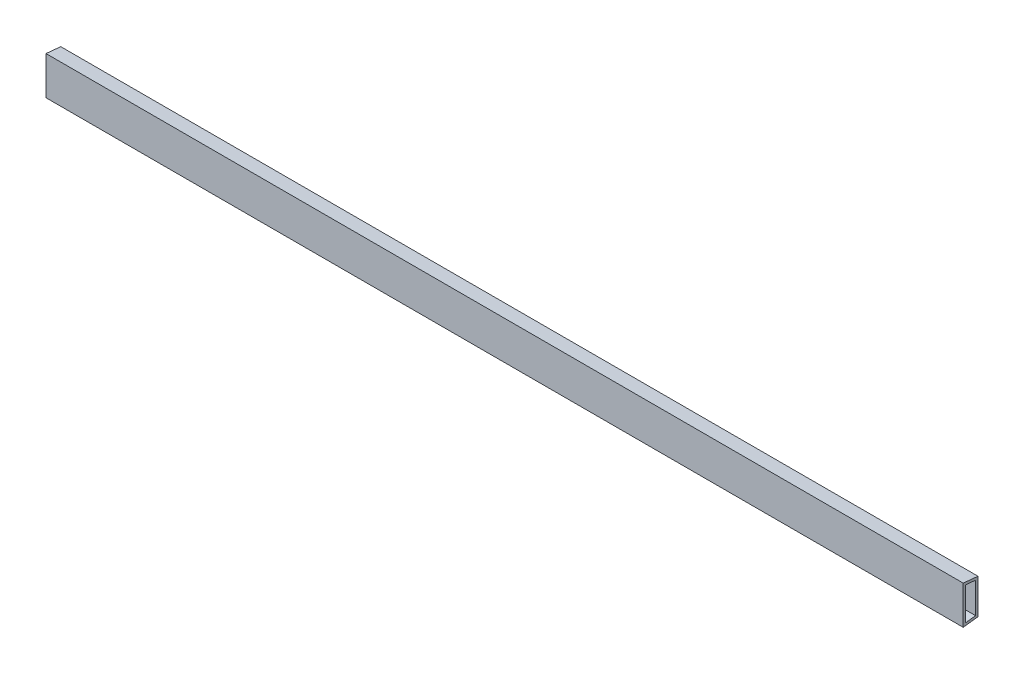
ISO-10303-21;
HEADER;
FILE_DESCRIPTION(('STEP AP214'),'2;1');
FILE_NAME('part.step','',(''),(''),'','','');
FILE_SCHEMA(('AUTOMOTIVE_DESIGN { 1 0 10303 214 1 1 1 1 }'));
ENDSEC;
DATA;
#1=APPLICATION_CONTEXT('core data for automotive mechanical design processes');
#2=APPLICATION_PROTOCOL_DEFINITION('international standard','automotive_design',2000,#1);
#3=PRODUCT_CONTEXT('',#1,'mechanical');
#4=PRODUCT('Part','Part','',(#3));
#5=PRODUCT_RELATED_PRODUCT_CATEGORY('part','',(#4));
#6=PRODUCT_DEFINITION_FORMATION('','',#4);
#7=PRODUCT_DEFINITION_CONTEXT('part definition',#1,'design');
#8=PRODUCT_DEFINITION('design','',#6,#7);
#9=PRODUCT_DEFINITION_SHAPE('','',#8);
#10=(LENGTH_UNIT() NAMED_UNIT(*) SI_UNIT(.MILLI.,.METRE.));
#11=(NAMED_UNIT(*) PLANE_ANGLE_UNIT() SI_UNIT($,.RADIAN.));
#12=(NAMED_UNIT(*) SI_UNIT($,.STERADIAN.) SOLID_ANGLE_UNIT());
#13=UNCERTAINTY_MEASURE_WITH_UNIT(LENGTH_MEASURE(1.E-05),#10,'distance_accuracy_value','');
#14=(GEOMETRIC_REPRESENTATION_CONTEXT(3) GLOBAL_UNCERTAINTY_ASSIGNED_CONTEXT((#13)) GLOBAL_UNIT_ASSIGNED_CONTEXT((#10,
#11,#12)) REPRESENTATION_CONTEXT('',''));
#15=CARTESIAN_POINT('',(0.,0.,0.));
#16=DIRECTION('',(0.,0.,1.));
#17=DIRECTION('',(1.,0.,0.));
#18=AXIS2_PLACEMENT_3D('',#15,#16,#17);
#19=CARTESIAN_POINT('',(147.6375,18.5842509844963,-65.8818843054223));
#20=DIRECTION('',(-1.,0.,0.));
#21=DIRECTION('',(0.,0.,1.));
#22=AXIS2_PLACEMENT_3D('',#19,#20,#21);
#23=PLANE('',#22);
#24=CARTESIAN_POINT('',(147.6375,18.3471431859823,-68.2625));
#25=CARTESIAN_POINT('',(147.6375,18.4164453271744,-67.5841444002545));
#26=CARTESIAN_POINT('',(147.6375,18.575171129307,-65.9971286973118));
#27=CARTESIAN_POINT('',(147.6375,18.7255912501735,-64.4092892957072));
#28=CARTESIAN_POINT('',(147.6375,18.8083146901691,-63.5));
#29=B_SPLINE_CURVE_WITH_KNOTS('',3,(#24,#25,#26,#27,#28),.UNSPECIFIED.,.F.,.F.,(4,1,4),
(1.26385443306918,1.27054059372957,1.2794933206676),.UNSPECIFIED.);
#30=CARTESIAN_POINT('',(147.6375,18.3471431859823,-68.2625));
#31=VERTEX_POINT('',#30);
#32=CARTESIAN_POINT('',(147.6375,18.8083146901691,-63.5));
#33=VERTEX_POINT('',#32);
#34=EDGE_CURVE('E192',#31,#33,#29,.T.);
#35=ORIENTED_EDGE('',*,*,#34,.T.);
#36=DIRECTION('',(0.,-1.,0.));
#37=VECTOR('',#36,1.);
#38=CARTESIAN_POINT('',(147.6375,18.8083146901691,-63.5));
#39=LINE('',#38,#37);
#40=CARTESIAN_POINT('',(147.6375,6.47451787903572,-63.5));
#41=VERTEX_POINT('',#40);
#42=EDGE_CURVE('E168',#33,#41,#39,.T.);
#43=ORIENTED_EDGE('',*,*,#42,.T.);
#44=CARTESIAN_POINT('',(147.6375,6.47451787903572,-63.5));
#45=CARTESIAN_POINT('',(147.6375,6.57659567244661,-64.3094319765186));
#46=CARTESIAN_POINT('',(147.6375,6.77097725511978,-65.8962764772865));
#47=CARTESIAN_POINT('',(147.6375,6.95405260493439,-67.4844731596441));
#48=CARTESIAN_POINT('',(147.6375,7.04085950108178,-68.2625));
#49=B_SPLINE_CURVE_WITH_KNOTS('',3,(#44,#45,#46,#47,#48),.UNSPECIFIED.,.F.,.F.,(4,1,4),
(0.725427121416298,0.733426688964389,0.741102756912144),.UNSPECIFIED.);
#50=CARTESIAN_POINT('',(147.6375,7.04085950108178,-68.2625));
#51=VERTEX_POINT('',#50);
#52=EDGE_CURVE('E161',#41,#51,#49,.T.);
#53=ORIENTED_EDGE('',*,*,#52,.T.);
#54=DIRECTION('',(0.,1.,0.));
#55=VECTOR('',#54,1.);
#56=CARTESIAN_POINT('',(147.6375,18.3471431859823,-68.2625));
#57=LINE('',#56,#55);
#58=EDGE_CURVE('E167',#51,#31,#57,.T.);
#59=ORIENTED_EDGE('',*,*,#58,.T.);
#60=EDGE_LOOP('',(#35,#43,#53,#59));
#61=FACE_BOUND('',#60,.T.);
#62=CARTESIAN_POINT('',(147.6375,17.6298121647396,-67.46875));
#63=CARTESIAN_POINT('',(147.6375,17.7362869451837,-66.4107849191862));
#64=CARTESIAN_POINT('',(147.6375,17.839293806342,-65.3524623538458));
#65=CARTESIAN_POINT('',(147.6375,17.9380619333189,-64.29375));
#66=B_SPLINE_CURVE_WITH_KNOTS('',3,(#62,#63,#64,#65),.UNSPECIFIED.,.F.,.F.,(4,4),
(1.26620096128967,1.27664599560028),.UNSPECIFIED.);
#67=CARTESIAN_POINT('',(147.6375,17.6298121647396,-67.46875));
#68=VERTEX_POINT('',#67);
#69=CARTESIAN_POINT('',(147.6375,17.9380619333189,-64.29375));
#70=VERTEX_POINT('',#69);
#71=EDGE_CURVE('E99',#68,#70,#66,.T.);
#72=ORIENTED_EDGE('',*,*,#71,.F.);
#73=DIRECTION('',(0.,1.,0.));
#74=VECTOR('',#73,1.);
#75=CARTESIAN_POINT('',(147.6375,17.6298121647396,-67.46875));
#76=LINE('',#75,#74);
#77=CARTESIAN_POINT('',(147.6375,7.75018981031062,-67.46875));
#78=VERTEX_POINT('',#77);
#79=EDGE_CURVE('E121',#78,#68,#76,.T.);
#80=ORIENTED_EDGE('',*,*,#79,.F.);
#81=CARTESIAN_POINT('',(147.6375,7.37346725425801,-64.29375));
#82=CARTESIAN_POINT('',(147.6375,7.50404126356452,-65.3514781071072));
#83=CARTESIAN_POINT('',(147.6375,7.62969544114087,-66.4098262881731));
#84=CARTESIAN_POINT('',(147.6375,7.75018981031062,-67.46875));
#85=B_SPLINE_CURVE_WITH_KNOTS('',3,(#81,#82,#83,#84),.UNSPECIFIED.,.F.,.F.,(4,4),
(0.72836186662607,0.738787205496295),.UNSPECIFIED.);
#86=CARTESIAN_POINT('',(147.6375,7.37346725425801,-64.29375));
#87=VERTEX_POINT('',#86);
#88=EDGE_CURVE('E119',#87,#78,#85,.T.);
#89=ORIENTED_EDGE('',*,*,#88,.F.);
#90=DIRECTION('',(0.,-1.,0.));
#91=VECTOR('',#90,1.);
#92=CARTESIAN_POINT('',(147.6375,17.9380619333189,-64.29375));
#93=LINE('',#92,#91);
#94=EDGE_CURVE('E107',#70,#87,#93,.T.);
#95=ORIENTED_EDGE('',*,*,#94,.F.);
#96=EDGE_LOOP('',(#72,#80,#89,#95));
#97=FACE_BOUND('',#96,.T.);
#98=ADVANCED_FACE('F33',(#61,#97),#23,.F.);
#99=CARTESIAN_POINT('',(-147.6375,18.5842509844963,-65.8818843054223));
#100=DIRECTION('',(-1.,0.,0.));
#101=DIRECTION('',(0.,0.,1.));
#102=AXIS2_PLACEMENT_3D('',#99,#100,#101);
#103=PLANE('',#102);
#104=CARTESIAN_POINT('',(-147.6375,18.3471431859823,-68.2625));
#105=CARTESIAN_POINT('',(-147.6375,18.4164453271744,-67.5841444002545));
#106=CARTESIAN_POINT('',(-147.6375,18.575171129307,-65.9971286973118));
#107=CARTESIAN_POINT('',(-147.6375,18.7255912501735,-64.4092892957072));
#108=CARTESIAN_POINT('',(-147.6375,18.8083146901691,-63.5));
#109=B_SPLINE_CURVE_WITH_KNOTS('',3,(#104,#105,#106,#107,#108),.UNSPECIFIED.,.F.,.F.,(4,1,4),
(1.26385443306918,1.27054059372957,1.2794933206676),.UNSPECIFIED.);
#110=CARTESIAN_POINT('',(-147.6375,18.3471431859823,-68.2625));
#111=VERTEX_POINT('',#110);
#112=CARTESIAN_POINT('',(-147.6375,18.8083146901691,-63.5));
#113=VERTEX_POINT('',#112);
#114=EDGE_CURVE('E115',#111,#113,#109,.T.);
#115=ORIENTED_EDGE('',*,*,#114,.F.);
#116=DIRECTION('',(0.,1.,0.));
#117=VECTOR('',#116,1.);
#118=CARTESIAN_POINT('',(-147.6375,18.3471431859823,-68.2625));
#119=LINE('',#118,#117);
#120=CARTESIAN_POINT('',(-147.6375,7.04085950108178,-68.2625));
#121=VERTEX_POINT('',#120);
#122=EDGE_CURVE('E187',#121,#111,#119,.T.);
#123=ORIENTED_EDGE('',*,*,#122,.F.);
#124=CARTESIAN_POINT('',(-147.6375,6.47451787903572,-63.5));
#125=CARTESIAN_POINT('',(-147.6375,6.57659567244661,-64.3094319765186));
#126=CARTESIAN_POINT('',(-147.6375,6.77097725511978,-65.8962764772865));
#127=CARTESIAN_POINT('',(-147.6375,6.95405260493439,-67.4844731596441));
#128=CARTESIAN_POINT('',(-147.6375,7.04085950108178,-68.2625));
#129=B_SPLINE_CURVE_WITH_KNOTS('',3,(#124,#125,#126,#127,#128),.UNSPECIFIED.,.F.,.F.,(4,1,4),
(0.725427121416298,0.733426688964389,0.741102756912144),.UNSPECIFIED.);
#130=CARTESIAN_POINT('',(-147.6375,6.47451787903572,-63.5));
#131=VERTEX_POINT('',#130);
#132=EDGE_CURVE('E183',#131,#121,#129,.T.);
#133=ORIENTED_EDGE('',*,*,#132,.F.);
#134=DIRECTION('',(0.,-1.,0.));
#135=VECTOR('',#134,1.);
#136=CARTESIAN_POINT('',(-147.6375,18.8083146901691,-63.5));
#137=LINE('',#136,#135);
#138=EDGE_CURVE('E178',#113,#131,#137,.T.);
#139=ORIENTED_EDGE('',*,*,#138,.F.);
#140=EDGE_LOOP('',(#115,#123,#133,#139));
#141=FACE_BOUND('',#140,.T.);
#142=DIRECTION('',(0.,1.,0.));
#143=VECTOR('',#142,1.);
#144=CARTESIAN_POINT('',(-147.6375,17.6298121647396,-67.46875));
#145=LINE('',#144,#143);
#146=CARTESIAN_POINT('',(-147.6375,7.75018981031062,-67.46875));
#147=VERTEX_POINT('',#146);
#148=CARTESIAN_POINT('',(-147.6375,17.6298121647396,-67.46875));
#149=VERTEX_POINT('',#148);
#150=EDGE_CURVE('E108',#147,#149,#145,.T.);
#151=ORIENTED_EDGE('',*,*,#150,.T.);
#152=CARTESIAN_POINT('',(-147.6375,17.6298121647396,-67.46875));
#153=CARTESIAN_POINT('',(-147.6375,17.7362869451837,-66.4107849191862));
#154=CARTESIAN_POINT('',(-147.6375,17.839293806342,-65.3524623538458));
#155=CARTESIAN_POINT('',(-147.6375,17.9380619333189,-64.29375));
#156=B_SPLINE_CURVE_WITH_KNOTS('',3,(#152,#153,#154,#155),.UNSPECIFIED.,.F.,.F.,(4,4),
(1.26620096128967,1.27664599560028),.UNSPECIFIED.);
#157=CARTESIAN_POINT('',(-147.6375,17.9380619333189,-64.29375));
#158=VERTEX_POINT('',#157);
#159=EDGE_CURVE('E57',#149,#158,#156,.T.);
#160=ORIENTED_EDGE('',*,*,#159,.T.);
#161=DIRECTION('',(0.,-1.,0.));
#162=VECTOR('',#161,1.);
#163=CARTESIAN_POINT('',(-147.6375,17.9380619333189,-64.29375));
#164=LINE('',#163,#162);
#165=CARTESIAN_POINT('',(-147.6375,7.37346725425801,-64.29375));
#166=VERTEX_POINT('',#165);
#167=EDGE_CURVE('E114',#158,#166,#164,.T.);
#168=ORIENTED_EDGE('',*,*,#167,.T.);
#169=CARTESIAN_POINT('',(-147.6375,7.37346725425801,-64.29375));
#170=CARTESIAN_POINT('',(-147.6375,7.50404126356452,-65.3514781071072));
#171=CARTESIAN_POINT('',(-147.6375,7.62969544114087,-66.4098262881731));
#172=CARTESIAN_POINT('',(-147.6375,7.75018981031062,-67.46875));
#173=B_SPLINE_CURVE_WITH_KNOTS('',3,(#169,#170,#171,#172),.UNSPECIFIED.,.F.,.F.,(4,4),
(0.72836186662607,0.738787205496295),.UNSPECIFIED.);
#174=EDGE_CURVE('E224',#166,#147,#173,.T.);
#175=ORIENTED_EDGE('',*,*,#174,.T.);
#176=EDGE_LOOP('',(#151,#160,#168,#175));
#177=FACE_BOUND('',#176,.T.);
#178=ADVANCED_FACE('F148',(#141,#177),#103,.T.);
#179=DIRECTION('',(-1.,0.,0.));
#180=VECTOR('',#179,1.);
#181=SURFACE_OF_LINEAR_EXTRUSION('',#29,#180);
#182=ORIENTED_EDGE('',*,*,#114,.T.);
#183=DIRECTION('',(-1.,0.,0.));
#184=VECTOR('',#183,1.);
#185=CARTESIAN_POINT('',(147.6375,18.8083146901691,-63.5));
#186=LINE('',#185,#184);
#187=EDGE_CURVE('E11',#33,#113,#186,.T.);
#188=ORIENTED_EDGE('',*,*,#187,.F.);
#189=ORIENTED_EDGE('',*,*,#34,.F.);
#190=DIRECTION('',(-1.,0.,0.));
#191=VECTOR('',#190,1.);
#192=CARTESIAN_POINT('',(147.6375,18.3471431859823,-68.2625));
#193=LINE('',#192,#191);
#194=EDGE_CURVE('E173',#31,#111,#193,.T.);
#195=ORIENTED_EDGE('',*,*,#194,.T.);
#196=EDGE_LOOP('',(#182,#188,#189,#195));
#197=FACE_BOUND('',#196,.T.);
#198=ADVANCED_FACE('F35',(#197),#181,.F.);
#199=CARTESIAN_POINT('',(147.6375,18.8083146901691,-63.5));
#200=DIRECTION('',(0.,0.,-1.));
#201=DIRECTION('',(0.,1.,0.));
#202=AXIS2_PLACEMENT_3D('',#199,#200,#201);
#203=PLANE('',#202);
#204=ORIENTED_EDGE('',*,*,#138,.T.);
#205=DIRECTION('',(-1.,0.,0.));
#206=VECTOR('',#205,1.);
#207=CARTESIAN_POINT('',(147.6375,6.47451787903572,-63.5));
#208=LINE('',#207,#206);
#209=EDGE_CURVE('E42',#41,#131,#208,.T.);
#210=ORIENTED_EDGE('',*,*,#209,.F.);
#211=ORIENTED_EDGE('',*,*,#42,.F.);
#212=ORIENTED_EDGE('',*,*,#187,.T.);
#213=EDGE_LOOP('',(#204,#210,#211,#212));
#214=FACE_BOUND('',#213,.T.);
#215=ADVANCED_FACE('F159',(#214),#203,.F.);
#216=DIRECTION('',(-1.,0.,0.));
#217=VECTOR('',#216,1.);
#218=SURFACE_OF_LINEAR_EXTRUSION('',#49,#217);
#219=ORIENTED_EDGE('',*,*,#132,.T.);
#220=DIRECTION('',(-1.,0.,0.));
#221=VECTOR('',#220,1.);
#222=CARTESIAN_POINT('',(147.6375,7.04085950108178,-68.2625));
#223=LINE('',#222,#221);
#224=EDGE_CURVE('E195',#51,#121,#223,.T.);
#225=ORIENTED_EDGE('',*,*,#224,.F.);
#226=ORIENTED_EDGE('',*,*,#52,.F.);
#227=ORIENTED_EDGE('',*,*,#209,.T.);
#228=EDGE_LOOP('',(#219,#225,#226,#227));
#229=FACE_BOUND('',#228,.T.);
#230=ADVANCED_FACE('F155',(#229),#218,.F.);
#231=CARTESIAN_POINT('',(147.6375,18.3471431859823,-68.2625));
#232=DIRECTION('',(0.,0.,1.));
#233=DIRECTION('',(1.,0.,0.));
#234=AXIS2_PLACEMENT_3D('',#231,#232,#233);
#235=PLANE('',#234);
#236=ORIENTED_EDGE('',*,*,#122,.T.);
#237=ORIENTED_EDGE('',*,*,#194,.F.);
#238=ORIENTED_EDGE('',*,*,#58,.F.);
#239=ORIENTED_EDGE('',*,*,#224,.T.);
#240=EDGE_LOOP('',(#236,#237,#238,#239));
#241=FACE_BOUND('',#240,.T.);
#242=ADVANCED_FACE('F145',(#241),#235,.F.);
#243=DIRECTION('',(-1.,0.,0.));
#244=VECTOR('',#243,1.);
#245=SURFACE_OF_LINEAR_EXTRUSION('',#66,#244);
#246=ORIENTED_EDGE('',*,*,#159,.F.);
#247=DIRECTION('',(-1.,0.,0.));
#248=VECTOR('',#247,1.);
#249=CARTESIAN_POINT('',(147.6375,17.6298121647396,-67.46875));
#250=LINE('',#249,#248);
#251=EDGE_CURVE('E103',#68,#149,#250,.T.);
#252=ORIENTED_EDGE('',*,*,#251,.F.);
#253=ORIENTED_EDGE('',*,*,#71,.T.);
#254=DIRECTION('',(-1.,0.,0.));
#255=VECTOR('',#254,1.);
#256=CARTESIAN_POINT('',(147.6375,17.9380619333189,-64.29375));
#257=LINE('',#256,#255);
#258=EDGE_CURVE('E102',#70,#158,#257,.T.);
#259=ORIENTED_EDGE('',*,*,#258,.T.);
#260=EDGE_LOOP('',(#246,#252,#253,#259));
#261=FACE_BOUND('',#260,.T.);
#262=ADVANCED_FACE('F101',(#261),#245,.T.);
#263=CARTESIAN_POINT('',(147.6375,17.9380619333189,-64.29375));
#264=DIRECTION('',(0.,0.,-1.));
#265=DIRECTION('',(0.,1.,0.));
#266=AXIS2_PLACEMENT_3D('',#263,#264,#265);
#267=PLANE('',#266);
#268=ORIENTED_EDGE('',*,*,#167,.F.);
#269=ORIENTED_EDGE('',*,*,#258,.F.);
#270=ORIENTED_EDGE('',*,*,#94,.T.);
#271=DIRECTION('',(-1.,0.,0.));
#272=VECTOR('',#271,1.);
#273=CARTESIAN_POINT('',(147.6375,7.37346725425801,-64.29375));
#274=LINE('',#273,#272);
#275=EDGE_CURVE('E116',#87,#166,#274,.T.);
#276=ORIENTED_EDGE('',*,*,#275,.T.);
#277=EDGE_LOOP('',(#268,#269,#270,#276));
#278=FACE_BOUND('',#277,.T.);
#279=ADVANCED_FACE('F111',(#278),#267,.T.);
#280=DIRECTION('',(-1.,0.,0.));
#281=VECTOR('',#280,1.);
#282=SURFACE_OF_LINEAR_EXTRUSION('',#85,#281);
#283=ORIENTED_EDGE('',*,*,#174,.F.);
#284=ORIENTED_EDGE('',*,*,#275,.F.);
#285=ORIENTED_EDGE('',*,*,#88,.T.);
#286=DIRECTION('',(-1.,0.,0.));
#287=VECTOR('',#286,1.);
#288=CARTESIAN_POINT('',(147.6375,7.75018981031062,-67.46875));
#289=LINE('',#288,#287);
#290=EDGE_CURVE('E49',#78,#147,#289,.T.);
#291=ORIENTED_EDGE('',*,*,#290,.T.);
#292=EDGE_LOOP('',(#283,#284,#285,#291));
#293=FACE_BOUND('',#292,.T.);
#294=ADVANCED_FACE('F135',(#293),#282,.T.);
#295=CARTESIAN_POINT('',(147.6375,17.6298121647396,-67.46875));
#296=DIRECTION('',(0.,0.,1.));
#297=DIRECTION('',(0.,-1.,0.));
#298=AXIS2_PLACEMENT_3D('',#295,#296,#297);
#299=PLANE('',#298);
#300=ORIENTED_EDGE('',*,*,#150,.F.);
#301=ORIENTED_EDGE('',*,*,#290,.F.);
#302=ORIENTED_EDGE('',*,*,#79,.T.);
#303=ORIENTED_EDGE('',*,*,#251,.T.);
#304=EDGE_LOOP('',(#300,#301,#302,#303));
#305=FACE_BOUND('',#304,.T.);
#306=ADVANCED_FACE('F139',(#305),#299,.T.);
#307=CLOSED_SHELL('',(#98,#178,#198,#215,#230,#242,#262,#279,#294,#306));
#308=MANIFOLD_SOLID_BREP('B2',#307);
#309=ADVANCED_BREP_SHAPE_REPRESENTATION('',(#18,#308),#14);
#310=SHAPE_DEFINITION_REPRESENTATION(#9,#309);
ENDSEC;
END-ISO-10303-21;
